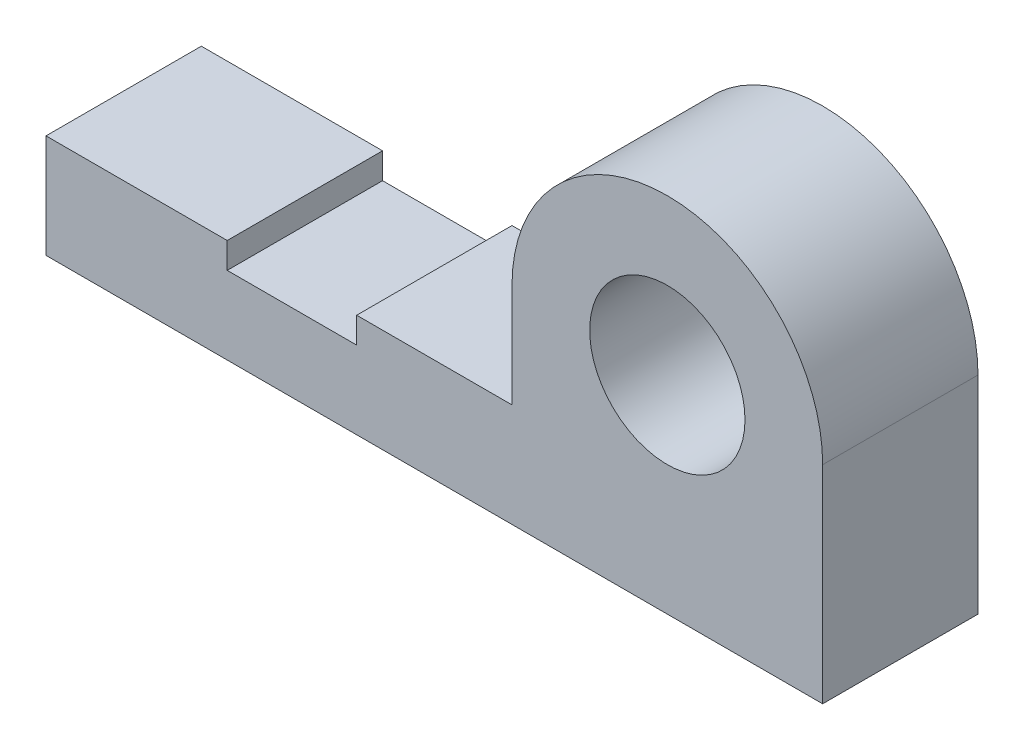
from build123d import *

# Parameters (mm, degrees)
SKETCH1_R           = 15
BOSS_EXTRUDE1_DEPTH = 30


with BuildPart() as part:
    # Sketch1 → Boss-Extrude1 (new body)
    with BuildSketch(Plane.XY):
        with BuildLine():
            Line((0, 0), (150, 0))
            Line((150, 0), (150, 40))
            ThreePointArc((150, 40), (120, 70), (90, 40))
            Line((90, 40), (90, 20))
            Line((90, 20), (60, 20))
            Line((60, 20), (60, 15))
            Line((60, 15), (35, 15))
            Line((35, 15), (35, 20))
            Line((35, 20), (0, 20))
            Line((0, 20), (0, 0))
        make_face()
        with Locations((120, 40)):
            Circle(SKETCH1_R, mode=Mode.SUBTRACT)
    extrude(amount=BOSS_EXTRUDE1_DEPTH)


solid = part.part
